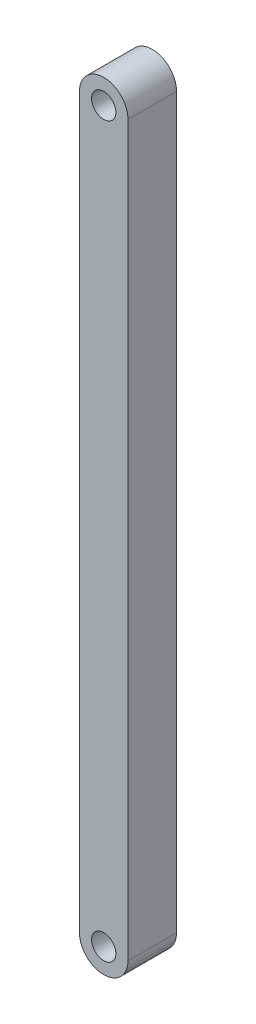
ISO-10303-21;
HEADER;
FILE_DESCRIPTION(('STEP AP214'),'2;1');
FILE_NAME('part.step','',(''),(''),'','','');
FILE_SCHEMA(('AUTOMOTIVE_DESIGN { 1 0 10303 214 1 1 1 1 }'));
ENDSEC;
DATA;
#1=APPLICATION_CONTEXT('core data for automotive mechanical design processes');
#2=APPLICATION_PROTOCOL_DEFINITION('international standard','automotive_design',2000,#1);
#3=PRODUCT_CONTEXT('',#1,'mechanical');
#4=PRODUCT('Part','Part','',(#3));
#5=PRODUCT_RELATED_PRODUCT_CATEGORY('part','',(#4));
#6=PRODUCT_DEFINITION_FORMATION('','',#4);
#7=PRODUCT_DEFINITION_CONTEXT('part definition',#1,'design');
#8=PRODUCT_DEFINITION('design','',#6,#7);
#9=PRODUCT_DEFINITION_SHAPE('','',#8);
#10=(LENGTH_UNIT() NAMED_UNIT(*) SI_UNIT(.MILLI.,.METRE.));
#11=(NAMED_UNIT(*) PLANE_ANGLE_UNIT() SI_UNIT($,.RADIAN.));
#12=(NAMED_UNIT(*) SI_UNIT($,.STERADIAN.) SOLID_ANGLE_UNIT());
#13=UNCERTAINTY_MEASURE_WITH_UNIT(LENGTH_MEASURE(1.E-05),#10,'distance_accuracy_value','');
#14=(GEOMETRIC_REPRESENTATION_CONTEXT(3) GLOBAL_UNCERTAINTY_ASSIGNED_CONTEXT((#13)) GLOBAL_UNIT_ASSIGNED_CONTEXT((#10,
#11,#12)) REPRESENTATION_CONTEXT('',''));
#15=CARTESIAN_POINT('',(0.,0.,0.));
#16=DIRECTION('',(0.,0.,1.));
#17=DIRECTION('',(1.,0.,0.));
#18=AXIS2_PLACEMENT_3D('',#15,#16,#17);
#19=CARTESIAN_POINT('',(0.,0.,-5.));
#20=DIRECTION('',(0.,0.,-1.));
#21=DIRECTION('',(-1.,0.,0.));
#22=AXIS2_PLACEMENT_3D('',#19,#20,#21);
#23=PLANE('',#22);
#24=CARTESIAN_POINT('',(0.,35.,-5.));
#25=DIRECTION('',(0.,0.,1.));
#26=DIRECTION('',(1.,0.,0.));
#27=AXIS2_PLACEMENT_3D('',#24,#25,#26);
#28=CIRCLE('',#27,2.5);
#29=CARTESIAN_POINT('',(2.5,35.,-5.));
#30=VERTEX_POINT('',#29);
#31=EDGE_CURVE('E105',#30,#30,#28,.T.);
#32=ORIENTED_EDGE('',*,*,#31,.T.);
#33=EDGE_LOOP('',(#32));
#34=FACE_BOUND('',#33,.T.);
#35=CARTESIAN_POINT('',(0.,-115.,-5.));
#36=DIRECTION('',(0.,0.,-1.));
#37=DIRECTION('',(1.,0.,0.));
#38=AXIS2_PLACEMENT_3D('',#35,#36,#37);
#39=CIRCLE('',#38,2.5);
#40=CARTESIAN_POINT('',(2.5,-115.,-5.));
#41=VERTEX_POINT('',#40);
#42=EDGE_CURVE('E93',#41,#41,#39,.T.);
#43=ORIENTED_EDGE('',*,*,#42,.F.);
#44=EDGE_LOOP('',(#43));
#45=FACE_BOUND('',#44,.T.);
#46=CARTESIAN_POINT('',(0.,-115.,-5.));
#47=DIRECTION('',(0.,0.,1.));
#48=DIRECTION('',(1.,0.,0.));
#49=AXIS2_PLACEMENT_3D('',#46,#47,#48);
#50=CIRCLE('',#49,5.);
#51=CARTESIAN_POINT('',(-5.,-115.,-5.));
#52=VERTEX_POINT('',#51);
#53=CARTESIAN_POINT('',(5.,-115.,-5.));
#54=VERTEX_POINT('',#53);
#55=EDGE_CURVE('E71',#52,#54,#50,.T.);
#56=ORIENTED_EDGE('',*,*,#55,.F.);
#57=DIRECTION('',(0.,-1.,0.));
#58=VECTOR('',#57,1.);
#59=CARTESIAN_POINT('',(-5.,40.,-5.));
#60=LINE('',#59,#58);
#61=CARTESIAN_POINT('',(-5.,35.,-5.));
#62=VERTEX_POINT('',#61);
#63=EDGE_CURVE('E11',#62,#52,#60,.T.);
#64=ORIENTED_EDGE('',*,*,#63,.F.);
#65=CARTESIAN_POINT('',(0.,35.,-5.));
#66=DIRECTION('',(0.,0.,-1.));
#67=DIRECTION('',(1.,0.,0.));
#68=AXIS2_PLACEMENT_3D('',#65,#66,#67);
#69=CIRCLE('',#68,5.);
#70=CARTESIAN_POINT('',(5.,35.,-5.));
#71=VERTEX_POINT('',#70);
#72=EDGE_CURVE('E95',#62,#71,#69,.T.);
#73=ORIENTED_EDGE('',*,*,#72,.T.);
#74=DIRECTION('',(0.,-1.,0.));
#75=VECTOR('',#74,1.);
#76=CARTESIAN_POINT('',(5.,40.,-5.));
#77=LINE('',#76,#75);
#78=EDGE_CURVE('E43',#71,#54,#77,.T.);
#79=ORIENTED_EDGE('',*,*,#78,.T.);
#80=EDGE_LOOP('',(#56,#64,#73,#79));
#81=FACE_BOUND('',#80,.T.);
#82=ADVANCED_FACE('F34',(#34,#45,#81),#23,.T.);
#83=CARTESIAN_POINT('',(0.,0.,5.));
#84=DIRECTION('',(0.,0.,-1.));
#85=DIRECTION('',(-1.,0.,0.));
#86=AXIS2_PLACEMENT_3D('',#83,#84,#85);
#87=PLANE('',#86);
#88=CARTESIAN_POINT('',(0.,35.,5.));
#89=DIRECTION('',(0.,0.,1.));
#90=DIRECTION('',(1.,0.,0.));
#91=AXIS2_PLACEMENT_3D('',#88,#89,#90);
#92=CIRCLE('',#91,2.5);
#93=CARTESIAN_POINT('',(2.5,35.,5.));
#94=VERTEX_POINT('',#93);
#95=EDGE_CURVE('E104',#94,#94,#92,.T.);
#96=ORIENTED_EDGE('',*,*,#95,.F.);
#97=EDGE_LOOP('',(#96));
#98=FACE_BOUND('',#97,.T.);
#99=CARTESIAN_POINT('',(0.,-115.,5.));
#100=DIRECTION('',(0.,0.,-1.));
#101=DIRECTION('',(1.,0.,0.));
#102=AXIS2_PLACEMENT_3D('',#99,#100,#101);
#103=CIRCLE('',#102,2.5);
#104=CARTESIAN_POINT('',(2.5,-115.,5.));
#105=VERTEX_POINT('',#104);
#106=EDGE_CURVE('E98',#105,#105,#103,.T.);
#107=ORIENTED_EDGE('',*,*,#106,.T.);
#108=EDGE_LOOP('',(#107));
#109=FACE_BOUND('',#108,.T.);
#110=DIRECTION('',(0.,-1.,0.));
#111=VECTOR('',#110,1.);
#112=CARTESIAN_POINT('',(-5.,40.,5.));
#113=LINE('',#112,#111);
#114=CARTESIAN_POINT('',(-5.,35.,5.));
#115=VERTEX_POINT('',#114);
#116=CARTESIAN_POINT('',(-5.,-115.,5.));
#117=VERTEX_POINT('',#116);
#118=EDGE_CURVE('E91',#115,#117,#113,.T.);
#119=ORIENTED_EDGE('',*,*,#118,.T.);
#120=CARTESIAN_POINT('',(0.,-115.,5.));
#121=DIRECTION('',(0.,0.,1.));
#122=DIRECTION('',(1.,0.,0.));
#123=AXIS2_PLACEMENT_3D('',#120,#121,#122);
#124=CIRCLE('',#123,5.);
#125=CARTESIAN_POINT('',(5.,-115.,5.));
#126=VERTEX_POINT('',#125);
#127=EDGE_CURVE('E77',#117,#126,#124,.T.);
#128=ORIENTED_EDGE('',*,*,#127,.T.);
#129=DIRECTION('',(0.,-1.,0.));
#130=VECTOR('',#129,1.);
#131=CARTESIAN_POINT('',(5.,40.,5.));
#132=LINE('',#131,#130);
#133=CARTESIAN_POINT('',(5.,35.,5.));
#134=VERTEX_POINT('',#133);
#135=EDGE_CURVE('E108',#134,#126,#132,.T.);
#136=ORIENTED_EDGE('',*,*,#135,.F.);
#137=CARTESIAN_POINT('',(0.,35.,5.));
#138=DIRECTION('',(0.,0.,-1.));
#139=DIRECTION('',(1.,0.,0.));
#140=AXIS2_PLACEMENT_3D('',#137,#138,#139);
#141=CIRCLE('',#140,5.);
#142=EDGE_CURVE('E92',#115,#134,#141,.T.);
#143=ORIENTED_EDGE('',*,*,#142,.F.);
#144=EDGE_LOOP('',(#119,#128,#136,#143));
#145=FACE_BOUND('',#144,.T.);
#146=ADVANCED_FACE('F114',(#98,#109,#145),#87,.F.);
#147=CARTESIAN_POINT('',(-5.,40.,-5.));
#148=DIRECTION('',(-1.,0.,0.));
#149=DIRECTION('',(0.,0.,1.));
#150=AXIS2_PLACEMENT_3D('',#147,#148,#149);
#151=PLANE('',#150);
#152=ORIENTED_EDGE('',*,*,#63,.T.);
#153=DIRECTION('',(0.,0.,1.));
#154=VECTOR('',#153,1.);
#155=CARTESIAN_POINT('',(-5.,-115.,-5.));
#156=LINE('',#155,#154);
#157=EDGE_CURVE('E80',#52,#117,#156,.T.);
#158=ORIENTED_EDGE('',*,*,#157,.T.);
#159=ORIENTED_EDGE('',*,*,#118,.F.);
#160=DIRECTION('',(0.,0.,1.));
#161=VECTOR('',#160,1.);
#162=CARTESIAN_POINT('',(-5.,35.,-5.));
#163=LINE('',#162,#161);
#164=EDGE_CURVE('E90',#62,#115,#163,.T.);
#165=ORIENTED_EDGE('',*,*,#164,.F.);
#166=EDGE_LOOP('',(#152,#158,#159,#165));
#167=FACE_BOUND('',#166,.T.);
#168=ADVANCED_FACE('F88',(#167),#151,.T.);
#169=CARTESIAN_POINT('',(5.,40.,-5.));
#170=DIRECTION('',(-1.,0.,0.));
#171=DIRECTION('',(0.,0.,1.));
#172=AXIS2_PLACEMENT_3D('',#169,#170,#171);
#173=PLANE('',#172);
#174=DIRECTION('',(0.,0.,1.));
#175=VECTOR('',#174,1.);
#176=CARTESIAN_POINT('',(5.,-115.,-5.));
#177=LINE('',#176,#175);
#178=EDGE_CURVE('E76',#54,#126,#177,.T.);
#179=ORIENTED_EDGE('',*,*,#178,.F.);
#180=ORIENTED_EDGE('',*,*,#78,.F.);
#181=DIRECTION('',(0.,0.,1.));
#182=VECTOR('',#181,1.);
#183=CARTESIAN_POINT('',(5.,35.,-5.));
#184=LINE('',#183,#182);
#185=EDGE_CURVE('E49',#71,#134,#184,.T.);
#186=ORIENTED_EDGE('',*,*,#185,.T.);
#187=ORIENTED_EDGE('',*,*,#135,.T.);
#188=EDGE_LOOP('',(#179,#180,#186,#187));
#189=FACE_BOUND('',#188,.T.);
#190=ADVANCED_FACE('F36',(#189),#173,.F.);
#191=CARTESIAN_POINT('',(0.,35.,-5.));
#192=DIRECTION('',(0.,0.,1.));
#193=DIRECTION('',(1.,0.,0.));
#194=AXIS2_PLACEMENT_3D('',#191,#192,#193);
#195=CYLINDRICAL_SURFACE('',#194,2.5);
#196=ORIENTED_EDGE('',*,*,#31,.F.);
#197=EDGE_LOOP('',(#196));
#198=FACE_BOUND('',#197,.T.);
#199=ORIENTED_EDGE('',*,*,#95,.T.);
#200=EDGE_LOOP('',(#199));
#201=FACE_BOUND('',#200,.T.);
#202=ADVANCED_FACE('F133',(#198,#201),#195,.F.);
#203=CARTESIAN_POINT('',(0.,35.,-5.));
#204=DIRECTION('',(0.,0.,1.));
#205=DIRECTION('',(1.,0.,0.));
#206=AXIS2_PLACEMENT_3D('',#203,#204,#205);
#207=CYLINDRICAL_SURFACE('',#206,5.);
#208=ORIENTED_EDGE('',*,*,#142,.T.);
#209=ORIENTED_EDGE('',*,*,#185,.F.);
#210=ORIENTED_EDGE('',*,*,#72,.F.);
#211=ORIENTED_EDGE('',*,*,#164,.T.);
#212=EDGE_LOOP('',(#208,#209,#210,#211));
#213=FACE_BOUND('',#212,.T.);
#214=ADVANCED_FACE('F116',(#213),#207,.T.);
#215=CARTESIAN_POINT('',(0.,-115.,-5.));
#216=DIRECTION('',(0.,0.,1.));
#217=DIRECTION('',(1.,0.,0.));
#218=AXIS2_PLACEMENT_3D('',#215,#216,#217);
#219=CYLINDRICAL_SURFACE('',#218,2.5);
#220=ORIENTED_EDGE('',*,*,#42,.T.);
#221=EDGE_LOOP('',(#220));
#222=FACE_BOUND('',#221,.T.);
#223=ORIENTED_EDGE('',*,*,#106,.F.);
#224=EDGE_LOOP('',(#223));
#225=FACE_BOUND('',#224,.T.);
#226=ADVANCED_FACE('F124',(#222,#225),#219,.F.);
#227=CARTESIAN_POINT('',(0.,-115.,-5.));
#228=DIRECTION('',(0.,0.,1.));
#229=DIRECTION('',(1.,0.,0.));
#230=AXIS2_PLACEMENT_3D('',#227,#228,#229);
#231=CYLINDRICAL_SURFACE('',#230,5.);
#232=ORIENTED_EDGE('',*,*,#127,.F.);
#233=ORIENTED_EDGE('',*,*,#157,.F.);
#234=ORIENTED_EDGE('',*,*,#55,.T.);
#235=ORIENTED_EDGE('',*,*,#178,.T.);
#236=EDGE_LOOP('',(#232,#233,#234,#235));
#237=FACE_BOUND('',#236,.T.);
#238=ADVANCED_FACE('F81',(#237),#231,.T.);
#239=CLOSED_SHELL('',(#82,#146,#168,#190,#202,#214,#226,#238));
#240=MANIFOLD_SOLID_BREP('B2',#239);
#241=ADVANCED_BREP_SHAPE_REPRESENTATION('',(#18,#240),#14);
#242=SHAPE_DEFINITION_REPRESENTATION(#9,#241);
ENDSEC;
END-ISO-10303-21;
